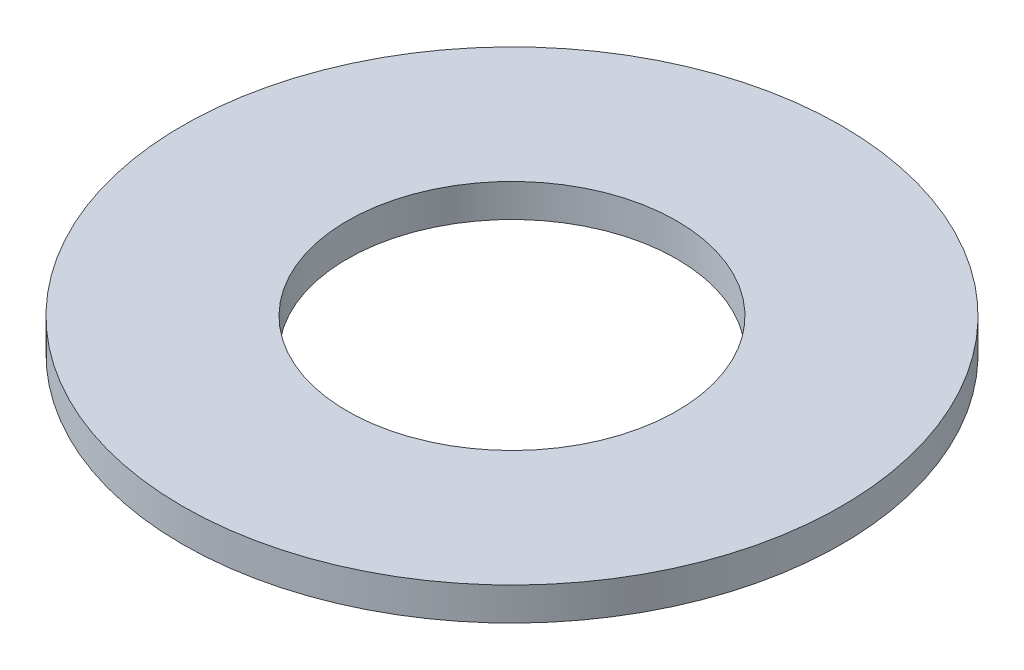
from build123d import *

# Parameters (mm, degrees)
ESQUISSE1_W = 5
ESQUISSE1_H = 1


with BuildPart() as part:
    # Esquisse1 → Base-R_volution (revolve)
    with BuildSketch(Plane.XY, mode=Mode.PRIVATE) as base_r_volution_sk:
        with Locations((7.5, 0.5)):
            Rectangle(ESQUISSE1_W, ESQUISSE1_H)
    revolve(base_r_volution_sk.sketch.rotate(Axis((0, 0, 0), (0, 1, 0)), 90), axis=Axis((0, 0, 0), (0, 1, 0)))


solid = part.part
